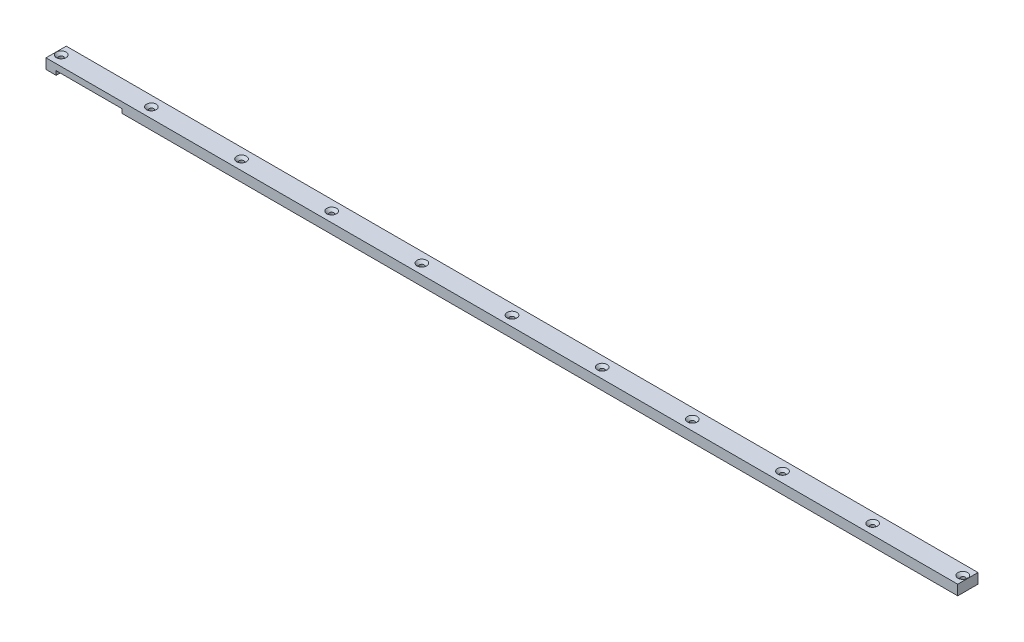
ISO-10303-21;
HEADER;
FILE_DESCRIPTION(('STEP AP214'),'2;1');
FILE_NAME('part.step','',(''),(''),'','','');
FILE_SCHEMA(('AUTOMOTIVE_DESIGN { 1 0 10303 214 1 1 1 1 }'));
ENDSEC;
DATA;
#1=APPLICATION_CONTEXT('core data for automotive mechanical design processes');
#2=APPLICATION_PROTOCOL_DEFINITION('international standard','automotive_design',2000,#1);
#3=PRODUCT_CONTEXT('',#1,'mechanical');
#4=PRODUCT('Part','Part','',(#3));
#5=PRODUCT_RELATED_PRODUCT_CATEGORY('part','',(#4));
#6=PRODUCT_DEFINITION_FORMATION('','',#4);
#7=PRODUCT_DEFINITION_CONTEXT('part definition',#1,'design');
#8=PRODUCT_DEFINITION('design','',#6,#7);
#9=PRODUCT_DEFINITION_SHAPE('','',#8);
#10=(LENGTH_UNIT() NAMED_UNIT(*) SI_UNIT(.MILLI.,.METRE.));
#11=(NAMED_UNIT(*) PLANE_ANGLE_UNIT() SI_UNIT($,.RADIAN.));
#12=(NAMED_UNIT(*) SI_UNIT($,.STERADIAN.) SOLID_ANGLE_UNIT());
#13=UNCERTAINTY_MEASURE_WITH_UNIT(LENGTH_MEASURE(1.E-05),#10,'distance_accuracy_value','');
#14=(GEOMETRIC_REPRESENTATION_CONTEXT(3) GLOBAL_UNCERTAINTY_ASSIGNED_CONTEXT((#13)) GLOBAL_UNIT_ASSIGNED_CONTEXT((#10,
#11,#12)) REPRESENTATION_CONTEXT('',''));
#15=CARTESIAN_POINT('',(0.,0.,0.));
#16=DIRECTION('',(0.,0.,1.));
#17=DIRECTION('',(1.,0.,0.));
#18=AXIS2_PLACEMENT_3D('',#15,#16,#17);
#19=CARTESIAN_POINT('',(-445.,10.,0.));
#20=DIRECTION('',(0.,1.,0.));
#21=DIRECTION('',(0.,0.,1.));
#22=AXIS2_PLACEMENT_3D('',#19,#20,#21);
#23=CYLINDRICAL_SURFACE('',#22,2.24999999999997);
#24=CARTESIAN_POINT('',(-445.,7.45000000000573,0.));
#25=DIRECTION('',(0.,1.,0.));
#26=DIRECTION('',(0.,0.,1.));
#27=AXIS2_PLACEMENT_3D('',#24,#25,#26);
#28=CIRCLE('',#27,2.25000000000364);
#29=CARTESIAN_POINT('',(-445.,7.45000000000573,2.25000000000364));
#30=VERTEX_POINT('',#29);
#31=EDGE_CURVE('E116',#30,#30,#28,.T.);
#32=ORIENTED_EDGE('',*,*,#31,.T.);
#33=EDGE_LOOP('',(#32));
#34=FACE_BOUND('',#33,.T.);
#35=CARTESIAN_POINT('',(-445.,0.,0.));
#36=DIRECTION('',(0.,1.,0.));
#37=DIRECTION('',(0.,0.,1.));
#38=AXIS2_PLACEMENT_3D('',#35,#36,#37);
#39=CIRCLE('',#38,2.24999999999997);
#40=CARTESIAN_POINT('',(-445.,0.,2.24999999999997));
#41=VERTEX_POINT('',#40);
#42=EDGE_CURVE('E117',#41,#41,#39,.F.);
#43=ORIENTED_EDGE('',*,*,#42,.T.);
#44=EDGE_LOOP('',(#43));
#45=FACE_BOUND('',#44,.T.);
#46=ADVANCED_FACE('F17',(#34,#45),#23,.F.);
#47=CARTESIAN_POINT('',(445.,10.,0.));
#48=DIRECTION('',(0.,1.,0.));
#49=DIRECTION('',(0.,0.,1.));
#50=AXIS2_PLACEMENT_3D('',#47,#48,#49);
#51=CYLINDRICAL_SURFACE('',#50,2.24999999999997);
#52=CARTESIAN_POINT('',(445.,7.45000000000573,0.));
#53=DIRECTION('',(0.,1.,0.));
#54=DIRECTION('',(0.,0.,1.));
#55=AXIS2_PLACEMENT_3D('',#52,#53,#54);
#56=CIRCLE('',#55,2.25000000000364);
#57=CARTESIAN_POINT('',(445.,7.45000000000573,2.25000000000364));
#58=VERTEX_POINT('',#57);
#59=EDGE_CURVE('E147',#58,#58,#56,.T.);
#60=ORIENTED_EDGE('',*,*,#59,.T.);
#61=EDGE_LOOP('',(#60));
#62=FACE_BOUND('',#61,.T.);
#63=CARTESIAN_POINT('',(445.,0.,0.));
#64=DIRECTION('',(0.,1.,0.));
#65=DIRECTION('',(0.,0.,1.));
#66=AXIS2_PLACEMENT_3D('',#63,#64,#65);
#67=CIRCLE('',#66,2.24999999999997);
#68=CARTESIAN_POINT('',(445.,0.,2.24999999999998));
#69=VERTEX_POINT('',#68);
#70=EDGE_CURVE('E20',#69,#69,#67,.F.);
#71=ORIENTED_EDGE('',*,*,#70,.T.);
#72=EDGE_LOOP('',(#71));
#73=FACE_BOUND('',#72,.T.);
#74=ADVANCED_FACE('F218',(#62,#73),#51,.F.);
#75=CARTESIAN_POINT('',(356.,10.,0.));
#76=DIRECTION('',(0.,1.,0.));
#77=DIRECTION('',(0.,0.,1.));
#78=AXIS2_PLACEMENT_3D('',#75,#76,#77);
#79=CYLINDRICAL_SURFACE('',#78,2.24999999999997);
#80=CARTESIAN_POINT('',(356.,7.45000000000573,0.));
#81=DIRECTION('',(0.,1.,0.));
#82=DIRECTION('',(0.,0.,1.));
#83=AXIS2_PLACEMENT_3D('',#80,#81,#82);
#84=CIRCLE('',#83,2.25000000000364);
#85=CARTESIAN_POINT('',(356.,7.45000000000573,2.25000000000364));
#86=VERTEX_POINT('',#85);
#87=EDGE_CURVE('E144',#86,#86,#84,.T.);
#88=ORIENTED_EDGE('',*,*,#87,.T.);
#89=EDGE_LOOP('',(#88));
#90=FACE_BOUND('',#89,.T.);
#91=CARTESIAN_POINT('',(356.,0.,0.));
#92=DIRECTION('',(0.,1.,0.));
#93=DIRECTION('',(0.,0.,1.));
#94=AXIS2_PLACEMENT_3D('',#91,#92,#93);
#95=CIRCLE('',#94,2.24999999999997);
#96=CARTESIAN_POINT('',(356.,0.,2.24999999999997));
#97=VERTEX_POINT('',#96);
#98=EDGE_CURVE('E211',#97,#97,#95,.F.);
#99=ORIENTED_EDGE('',*,*,#98,.T.);
#100=EDGE_LOOP('',(#99));
#101=FACE_BOUND('',#100,.T.);
#102=ADVANCED_FACE('F356',(#90,#101),#79,.F.);
#103=CARTESIAN_POINT('',(267.,10.,0.));
#104=DIRECTION('',(0.,1.,0.));
#105=DIRECTION('',(0.,0.,1.));
#106=AXIS2_PLACEMENT_3D('',#103,#104,#105);
#107=CYLINDRICAL_SURFACE('',#106,2.24999999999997);
#108=CARTESIAN_POINT('',(267.,7.45000000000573,0.));
#109=DIRECTION('',(0.,1.,0.));
#110=DIRECTION('',(0.,0.,1.));
#111=AXIS2_PLACEMENT_3D('',#108,#109,#110);
#112=CIRCLE('',#111,2.25000000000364);
#113=CARTESIAN_POINT('',(267.,7.45000000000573,2.25000000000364));
#114=VERTEX_POINT('',#113);
#115=EDGE_CURVE('E141',#114,#114,#112,.T.);
#116=ORIENTED_EDGE('',*,*,#115,.T.);
#117=EDGE_LOOP('',(#116));
#118=FACE_BOUND('',#117,.T.);
#119=CARTESIAN_POINT('',(267.,0.,0.));
#120=DIRECTION('',(0.,1.,0.));
#121=DIRECTION('',(0.,0.,1.));
#122=AXIS2_PLACEMENT_3D('',#119,#120,#121);
#123=CIRCLE('',#122,2.24999999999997);
#124=CARTESIAN_POINT('',(267.,0.,2.24999999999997));
#125=VERTEX_POINT('',#124);
#126=EDGE_CURVE('E209',#125,#125,#123,.F.);
#127=ORIENTED_EDGE('',*,*,#126,.T.);
#128=EDGE_LOOP('',(#127));
#129=FACE_BOUND('',#128,.T.);
#130=ADVANCED_FACE('F363',(#118,#129),#107,.F.);
#131=CARTESIAN_POINT('',(178.,10.,0.));
#132=DIRECTION('',(0.,1.,0.));
#133=DIRECTION('',(0.,0.,1.));
#134=AXIS2_PLACEMENT_3D('',#131,#132,#133);
#135=CYLINDRICAL_SURFACE('',#134,2.25);
#136=CARTESIAN_POINT('',(178.,7.45000000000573,0.));
#137=DIRECTION('',(0.,1.,0.));
#138=DIRECTION('',(0.,0.,1.));
#139=AXIS2_PLACEMENT_3D('',#136,#137,#138);
#140=CIRCLE('',#139,2.25000000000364);
#141=CARTESIAN_POINT('',(178.,7.45000000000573,2.25000000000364));
#142=VERTEX_POINT('',#141);
#143=EDGE_CURVE('E138',#142,#142,#140,.T.);
#144=ORIENTED_EDGE('',*,*,#143,.T.);
#145=EDGE_LOOP('',(#144));
#146=FACE_BOUND('',#145,.T.);
#147=CARTESIAN_POINT('',(178.,0.,0.));
#148=DIRECTION('',(0.,1.,0.));
#149=DIRECTION('',(0.,0.,1.));
#150=AXIS2_PLACEMENT_3D('',#147,#148,#149);
#151=CIRCLE('',#150,2.25);
#152=CARTESIAN_POINT('',(178.,0.,2.25));
#153=VERTEX_POINT('',#152);
#154=EDGE_CURVE('E206',#153,#153,#151,.F.);
#155=ORIENTED_EDGE('',*,*,#154,.T.);
#156=EDGE_LOOP('',(#155));
#157=FACE_BOUND('',#156,.T.);
#158=ADVANCED_FACE('F369',(#146,#157),#135,.F.);
#159=CARTESIAN_POINT('',(89.,10.,0.));
#160=DIRECTION('',(0.,1.,0.));
#161=DIRECTION('',(0.,0.,1.));
#162=AXIS2_PLACEMENT_3D('',#159,#160,#161);
#163=CYLINDRICAL_SURFACE('',#162,2.25);
#164=CARTESIAN_POINT('',(89.,7.45000000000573,0.));
#165=DIRECTION('',(0.,1.,0.));
#166=DIRECTION('',(0.,0.,1.));
#167=AXIS2_PLACEMENT_3D('',#164,#165,#166);
#168=CIRCLE('',#167,2.25000000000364);
#169=CARTESIAN_POINT('',(89.,7.45000000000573,2.25000000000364));
#170=VERTEX_POINT('',#169);
#171=EDGE_CURVE('E135',#170,#170,#168,.T.);
#172=ORIENTED_EDGE('',*,*,#171,.T.);
#173=EDGE_LOOP('',(#172));
#174=FACE_BOUND('',#173,.T.);
#175=CARTESIAN_POINT('',(89.,0.,0.));
#176=DIRECTION('',(0.,1.,0.));
#177=DIRECTION('',(0.,0.,1.));
#178=AXIS2_PLACEMENT_3D('',#175,#176,#177);
#179=CIRCLE('',#178,2.25);
#180=CARTESIAN_POINT('',(89.,0.,2.25));
#181=VERTEX_POINT('',#180);
#182=EDGE_CURVE('E203',#181,#181,#179,.F.);
#183=ORIENTED_EDGE('',*,*,#182,.T.);
#184=EDGE_LOOP('',(#183));
#185=FACE_BOUND('',#184,.T.);
#186=ADVANCED_FACE('F373',(#174,#185),#163,.F.);
#187=CARTESIAN_POINT('',(0.,10.,0.));
#188=DIRECTION('',(0.,1.,0.));
#189=DIRECTION('',(0.,0.,1.));
#190=AXIS2_PLACEMENT_3D('',#187,#188,#189);
#191=CYLINDRICAL_SURFACE('',#190,2.25);
#192=CARTESIAN_POINT('',(0.,7.44999999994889,0.));
#193=DIRECTION('',(0.,1.,0.));
#194=DIRECTION('',(0.,0.,1.));
#195=AXIS2_PLACEMENT_3D('',#192,#193,#194);
#196=CIRCLE('',#195,2.25000000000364);
#197=CARTESIAN_POINT('',(0.,7.44999999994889,2.25000000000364));
#198=VERTEX_POINT('',#197);
#199=EDGE_CURVE('E132',#198,#198,#196,.T.);
#200=ORIENTED_EDGE('',*,*,#199,.T.);
#201=EDGE_LOOP('',(#200));
#202=FACE_BOUND('',#201,.T.);
#203=CARTESIAN_POINT('',(0.,0.,0.));
#204=DIRECTION('',(0.,1.,0.));
#205=DIRECTION('',(0.,0.,1.));
#206=AXIS2_PLACEMENT_3D('',#203,#204,#205);
#207=CIRCLE('',#206,2.25);
#208=CARTESIAN_POINT('',(0.,0.,2.25));
#209=VERTEX_POINT('',#208);
#210=EDGE_CURVE('E200',#209,#209,#207,.F.);
#211=ORIENTED_EDGE('',*,*,#210,.T.);
#212=EDGE_LOOP('',(#211));
#213=FACE_BOUND('',#212,.T.);
#214=ADVANCED_FACE('F377',(#202,#213),#191,.F.);
#215=CARTESIAN_POINT('',(-89.,10.,0.));
#216=DIRECTION('',(0.,1.,0.));
#217=DIRECTION('',(0.,0.,1.));
#218=AXIS2_PLACEMENT_3D('',#215,#216,#217);
#219=CYLINDRICAL_SURFACE('',#218,2.25);
#220=CARTESIAN_POINT('',(-89.,7.45000000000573,0.));
#221=DIRECTION('',(0.,1.,0.));
#222=DIRECTION('',(0.,0.,1.));
#223=AXIS2_PLACEMENT_3D('',#220,#221,#222);
#224=CIRCLE('',#223,2.25000000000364);
#225=CARTESIAN_POINT('',(-89.,7.45000000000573,2.25000000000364));
#226=VERTEX_POINT('',#225);
#227=EDGE_CURVE('E129',#226,#226,#224,.T.);
#228=ORIENTED_EDGE('',*,*,#227,.T.);
#229=EDGE_LOOP('',(#228));
#230=FACE_BOUND('',#229,.T.);
#231=CARTESIAN_POINT('',(-89.,0.,0.));
#232=DIRECTION('',(0.,1.,0.));
#233=DIRECTION('',(0.,0.,1.));
#234=AXIS2_PLACEMENT_3D('',#231,#232,#233);
#235=CIRCLE('',#234,2.25);
#236=CARTESIAN_POINT('',(-89.,0.,2.25));
#237=VERTEX_POINT('',#236);
#238=EDGE_CURVE('E197',#237,#237,#235,.F.);
#239=ORIENTED_EDGE('',*,*,#238,.T.);
#240=EDGE_LOOP('',(#239));
#241=FACE_BOUND('',#240,.T.);
#242=ADVANCED_FACE('F381',(#230,#241),#219,.F.);
#243=CARTESIAN_POINT('',(-178.,10.,0.));
#244=DIRECTION('',(0.,1.,0.));
#245=DIRECTION('',(0.,0.,1.));
#246=AXIS2_PLACEMENT_3D('',#243,#244,#245);
#247=CYLINDRICAL_SURFACE('',#246,2.25);
#248=CARTESIAN_POINT('',(-178.,7.45000000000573,0.));
#249=DIRECTION('',(0.,1.,0.));
#250=DIRECTION('',(0.,0.,1.));
#251=AXIS2_PLACEMENT_3D('',#248,#249,#250);
#252=CIRCLE('',#251,2.25000000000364);
#253=CARTESIAN_POINT('',(-178.,7.45000000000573,2.25000000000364));
#254=VERTEX_POINT('',#253);
#255=EDGE_CURVE('E126',#254,#254,#252,.T.);
#256=ORIENTED_EDGE('',*,*,#255,.T.);
#257=EDGE_LOOP('',(#256));
#258=FACE_BOUND('',#257,.T.);
#259=CARTESIAN_POINT('',(-178.,0.,0.));
#260=DIRECTION('',(0.,1.,0.));
#261=DIRECTION('',(0.,0.,1.));
#262=AXIS2_PLACEMENT_3D('',#259,#260,#261);
#263=CIRCLE('',#262,2.25);
#264=CARTESIAN_POINT('',(-178.,0.,2.25));
#265=VERTEX_POINT('',#264);
#266=EDGE_CURVE('E194',#265,#265,#263,.F.);
#267=ORIENTED_EDGE('',*,*,#266,.T.);
#268=EDGE_LOOP('',(#267));
#269=FACE_BOUND('',#268,.T.);
#270=ADVANCED_FACE('F385',(#258,#269),#247,.F.);
#271=CARTESIAN_POINT('',(-267.,10.,0.));
#272=DIRECTION('',(0.,1.,0.));
#273=DIRECTION('',(0.,0.,1.));
#274=AXIS2_PLACEMENT_3D('',#271,#272,#273);
#275=CYLINDRICAL_SURFACE('',#274,2.24999999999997);
#276=CARTESIAN_POINT('',(-267.,7.45000000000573,0.));
#277=DIRECTION('',(0.,1.,0.));
#278=DIRECTION('',(0.,0.,1.));
#279=AXIS2_PLACEMENT_3D('',#276,#277,#278);
#280=CIRCLE('',#279,2.25000000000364);
#281=CARTESIAN_POINT('',(-267.,7.45000000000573,2.25000000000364));
#282=VERTEX_POINT('',#281);
#283=EDGE_CURVE('E123',#282,#282,#280,.T.);
#284=ORIENTED_EDGE('',*,*,#283,.T.);
#285=EDGE_LOOP('',(#284));
#286=FACE_BOUND('',#285,.T.);
#287=CARTESIAN_POINT('',(-267.,0.,0.));
#288=DIRECTION('',(0.,1.,0.));
#289=DIRECTION('',(0.,0.,1.));
#290=AXIS2_PLACEMENT_3D('',#287,#288,#289);
#291=CIRCLE('',#290,2.24999999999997);
#292=CARTESIAN_POINT('',(-267.,0.,2.24999999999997));
#293=VERTEX_POINT('',#292);
#294=EDGE_CURVE('E191',#293,#293,#291,.F.);
#295=ORIENTED_EDGE('',*,*,#294,.T.);
#296=EDGE_LOOP('',(#295));
#297=FACE_BOUND('',#296,.T.);
#298=ADVANCED_FACE('F230',(#286,#297),#275,.F.);
#299=CARTESIAN_POINT('',(-356.,10.,0.));
#300=DIRECTION('',(0.,1.,0.));
#301=DIRECTION('',(0.,0.,1.));
#302=AXIS2_PLACEMENT_3D('',#299,#300,#301);
#303=CYLINDRICAL_SURFACE('',#302,2.24999999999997);
#304=CARTESIAN_POINT('',(-356.,7.45000000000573,0.));
#305=DIRECTION('',(0.,1.,0.));
#306=DIRECTION('',(0.,0.,1.));
#307=AXIS2_PLACEMENT_3D('',#304,#305,#306);
#308=CIRCLE('',#307,2.25000000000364);
#309=CARTESIAN_POINT('',(-356.,7.45000000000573,2.25000000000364));
#310=VERTEX_POINT('',#309);
#311=EDGE_CURVE('E113',#310,#310,#308,.T.);
#312=ORIENTED_EDGE('',*,*,#311,.T.);
#313=EDGE_LOOP('',(#312));
#314=FACE_BOUND('',#313,.T.);
#315=CARTESIAN_POINT('',(-356.,0.,0.));
#316=DIRECTION('',(0.,1.,0.));
#317=DIRECTION('',(0.,0.,1.));
#318=AXIS2_PLACEMENT_3D('',#315,#316,#317);
#319=CIRCLE('',#318,2.24999999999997);
#320=CARTESIAN_POINT('',(-356.,0.,2.24999999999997));
#321=VERTEX_POINT('',#320);
#322=EDGE_CURVE('E93',#321,#321,#319,.F.);
#323=ORIENTED_EDGE('',*,*,#322,.T.);
#324=EDGE_LOOP('',(#323));
#325=FACE_BOUND('',#324,.T.);
#326=ADVANCED_FACE('F221',(#314,#325),#303,.F.);
#327=CARTESIAN_POINT('',(0.,0.,0.));
#328=DIRECTION('',(0.,1.,0.));
#329=DIRECTION('',(0.,0.,1.));
#330=AXIS2_PLACEMENT_3D('',#327,#328,#329);
#331=PLANE('',#330);
#332=DIRECTION('',(0.,0.,-1.));
#333=VECTOR('',#332,1.);
#334=CARTESIAN_POINT('',(-375.,0.,10.));
#335=LINE('',#334,#333);
#336=CARTESIAN_POINT('',(-375.,0.,10.));
#337=VERTEX_POINT('',#336);
#338=CARTESIAN_POINT('',(-375.,0.,-10.));
#339=VERTEX_POINT('',#338);
#340=EDGE_CURVE('E84',#337,#339,#335,.T.);
#341=ORIENTED_EDGE('',*,*,#340,.T.);
#342=DIRECTION('',(1.,0.,0.));
#343=VECTOR('',#342,1.);
#344=CARTESIAN_POINT('',(-450.,0.,-10.));
#345=LINE('',#344,#343);
#346=CARTESIAN_POINT('',(450.,0.,-10.));
#347=VERTEX_POINT('',#346);
#348=EDGE_CURVE('E88',#339,#347,#345,.T.);
#349=ORIENTED_EDGE('',*,*,#348,.T.);
#350=DIRECTION('',(0.,0.,1.));
#351=VECTOR('',#350,1.);
#352=CARTESIAN_POINT('',(450.,0.,-10.));
#353=LINE('',#352,#351);
#354=CARTESIAN_POINT('',(450.,0.,10.));
#355=VERTEX_POINT('',#354);
#356=EDGE_CURVE('E100',#347,#355,#353,.T.);
#357=ORIENTED_EDGE('',*,*,#356,.T.);
#358=DIRECTION('',(-1.,0.,0.));
#359=VECTOR('',#358,1.);
#360=CARTESIAN_POINT('',(-450.,0.,10.));
#361=LINE('',#360,#359);
#362=EDGE_CURVE('E91',#355,#337,#361,.T.);
#363=ORIENTED_EDGE('',*,*,#362,.T.);
#364=EDGE_LOOP('',(#341,#349,#357,#363));
#365=FACE_BOUND('',#364,.T.);
#366=ORIENTED_EDGE('',*,*,#322,.F.);
#367=EDGE_LOOP('',(#366));
#368=FACE_BOUND('',#367,.T.);
#369=ORIENTED_EDGE('',*,*,#294,.F.);
#370=EDGE_LOOP('',(#369));
#371=FACE_BOUND('',#370,.T.);
#372=ORIENTED_EDGE('',*,*,#266,.F.);
#373=EDGE_LOOP('',(#372));
#374=FACE_BOUND('',#373,.T.);
#375=ORIENTED_EDGE('',*,*,#238,.F.);
#376=EDGE_LOOP('',(#375));
#377=FACE_BOUND('',#376,.T.);
#378=ORIENTED_EDGE('',*,*,#210,.F.);
#379=EDGE_LOOP('',(#378));
#380=FACE_BOUND('',#379,.T.);
#381=ORIENTED_EDGE('',*,*,#182,.F.);
#382=EDGE_LOOP('',(#381));
#383=FACE_BOUND('',#382,.T.);
#384=ORIENTED_EDGE('',*,*,#154,.F.);
#385=EDGE_LOOP('',(#384));
#386=FACE_BOUND('',#385,.T.);
#387=ORIENTED_EDGE('',*,*,#126,.F.);
#388=EDGE_LOOP('',(#387));
#389=FACE_BOUND('',#388,.T.);
#390=ORIENTED_EDGE('',*,*,#98,.F.);
#391=EDGE_LOOP('',(#390));
#392=FACE_BOUND('',#391,.T.);
#393=ORIENTED_EDGE('',*,*,#70,.F.);
#394=EDGE_LOOP('',(#393));
#395=FACE_BOUND('',#394,.T.);
#396=ADVANCED_FACE('F85',(#365,#368,#371,#374,#377,#380,#383,#386,#389,#392,#395),#331,.F.);
#397=CARTESIAN_POINT('',(-375.,0.,10.));
#398=DIRECTION('',(1.,0.,0.));
#399=DIRECTION('',(0.,0.,-1.));
#400=AXIS2_PLACEMENT_3D('',#397,#398,#399);
#401=PLANE('',#400);
#402=ORIENTED_EDGE('',*,*,#340,.F.);
#403=DIRECTION('',(0.,1.,0.));
#404=VECTOR('',#403,1.);
#405=CARTESIAN_POINT('',(-375.,10.,10.));
#406=LINE('',#405,#404);
#407=CARTESIAN_POINT('',(-375.,3.99999999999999,10.));
#408=VERTEX_POINT('',#407);
#409=EDGE_CURVE('E316',#337,#408,#406,.T.);
#410=ORIENTED_EDGE('',*,*,#409,.T.);
#411=DIRECTION('',(0.,0.,1.));
#412=VECTOR('',#411,1.);
#413=CARTESIAN_POINT('',(-375.,3.99999999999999,10.));
#414=LINE('',#413,#412);
#415=CARTESIAN_POINT('',(-375.,3.99999999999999,-10.));
#416=VERTEX_POINT('',#415);
#417=EDGE_CURVE('E79',#408,#416,#414,.F.);
#418=ORIENTED_EDGE('',*,*,#417,.T.);
#419=DIRECTION('',(0.,1.,0.));
#420=VECTOR('',#419,1.);
#421=CARTESIAN_POINT('',(-375.,10.,-10.));
#422=LINE('',#421,#420);
#423=EDGE_CURVE('E96',#416,#339,#422,.F.);
#424=ORIENTED_EDGE('',*,*,#423,.T.);
#425=EDGE_LOOP('',(#402,#410,#418,#424));
#426=FACE_BOUND('',#425,.T.);
#427=ADVANCED_FACE('F97',(#426),#401,.F.);
#428=CARTESIAN_POINT('',(-440.,4.,10.));
#429=DIRECTION('',(0.,1.,0.));
#430=DIRECTION('',(-1.,0.,0.));
#431=AXIS2_PLACEMENT_3D('',#428,#429,#430);
#432=PLANE('',#431);
#433=ORIENTED_EDGE('',*,*,#417,.F.);
#434=DIRECTION('',(-1.,0.,0.));
#435=VECTOR('',#434,1.);
#436=CARTESIAN_POINT('',(-450.,3.99999999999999,10.));
#437=LINE('',#436,#435);
#438=CARTESIAN_POINT('',(-440.,4.,10.));
#439=VERTEX_POINT('',#438);
#440=EDGE_CURVE('E312',#408,#439,#437,.T.);
#441=ORIENTED_EDGE('',*,*,#440,.T.);
#442=DIRECTION('',(0.,0.,1.));
#443=VECTOR('',#442,1.);
#444=CARTESIAN_POINT('',(-440.,4.,10.));
#445=LINE('',#444,#443);
#446=CARTESIAN_POINT('',(-440.,4.,-10.));
#447=VERTEX_POINT('',#446);
#448=EDGE_CURVE('E118',#439,#447,#445,.F.);
#449=ORIENTED_EDGE('',*,*,#448,.T.);
#450=DIRECTION('',(1.,0.,0.));
#451=VECTOR('',#450,1.);
#452=CARTESIAN_POINT('',(-450.,4.,-10.));
#453=LINE('',#452,#451);
#454=EDGE_CURVE('E314',#447,#416,#453,.T.);
#455=ORIENTED_EDGE('',*,*,#454,.T.);
#456=EDGE_LOOP('',(#433,#441,#449,#455));
#457=FACE_BOUND('',#456,.T.);
#458=ADVANCED_FACE('F228',(#457),#432,.F.);
#459=CARTESIAN_POINT('',(-440.,0.,10.));
#460=DIRECTION('',(-1.,0.,0.));
#461=DIRECTION('',(0.,0.,1.));
#462=AXIS2_PLACEMENT_3D('',#459,#460,#461);
#463=PLANE('',#462);
#464=ORIENTED_EDGE('',*,*,#448,.F.);
#465=DIRECTION('',(0.,1.,0.));
#466=VECTOR('',#465,1.);
#467=CARTESIAN_POINT('',(-440.,10.,10.));
#468=LINE('',#467,#466);
#469=CARTESIAN_POINT('',(-440.,0.,10.));
#470=VERTEX_POINT('',#469);
#471=EDGE_CURVE('E318',#439,#470,#468,.F.);
#472=ORIENTED_EDGE('',*,*,#471,.T.);
#473=DIRECTION('',(0.,0.,1.));
#474=VECTOR('',#473,1.);
#475=CARTESIAN_POINT('',(-440.,0.,0.));
#476=LINE('',#475,#474);
#477=CARTESIAN_POINT('',(-440.,0.,-10.));
#478=VERTEX_POINT('',#477);
#479=EDGE_CURVE('E114',#470,#478,#476,.F.);
#480=ORIENTED_EDGE('',*,*,#479,.T.);
#481=DIRECTION('',(0.,1.,0.));
#482=VECTOR('',#481,1.);
#483=CARTESIAN_POINT('',(-440.,10.,-10.));
#484=LINE('',#483,#482);
#485=EDGE_CURVE('E335',#478,#447,#484,.T.);
#486=ORIENTED_EDGE('',*,*,#485,.T.);
#487=EDGE_LOOP('',(#464,#472,#480,#486));
#488=FACE_BOUND('',#487,.T.);
#489=ADVANCED_FACE('F302',(#488),#463,.F.);
#490=CARTESIAN_POINT('',(0.,0.,0.));
#491=DIRECTION('',(0.,1.,0.));
#492=DIRECTION('',(0.,0.,1.));
#493=AXIS2_PLACEMENT_3D('',#490,#491,#492);
#494=PLANE('',#493);
#495=ORIENTED_EDGE('',*,*,#479,.F.);
#496=DIRECTION('',(-1.,0.,0.));
#497=VECTOR('',#496,1.);
#498=CARTESIAN_POINT('',(-450.,0.,10.));
#499=LINE('',#498,#497);
#500=CARTESIAN_POINT('',(-450.,0.,10.));
#501=VERTEX_POINT('',#500);
#502=EDGE_CURVE('E186',#470,#501,#499,.T.);
#503=ORIENTED_EDGE('',*,*,#502,.T.);
#504=DIRECTION('',(0.,0.,-1.));
#505=VECTOR('',#504,1.);
#506=CARTESIAN_POINT('',(-450.,0.,-10.));
#507=LINE('',#506,#505);
#508=CARTESIAN_POINT('',(-450.,0.,-10.));
#509=VERTEX_POINT('',#508);
#510=EDGE_CURVE('E329',#501,#509,#507,.T.);
#511=ORIENTED_EDGE('',*,*,#510,.T.);
#512=DIRECTION('',(1.,0.,0.));
#513=VECTOR('',#512,1.);
#514=CARTESIAN_POINT('',(-450.,0.,-10.));
#515=LINE('',#514,#513);
#516=EDGE_CURVE('E108',#509,#478,#515,.T.);
#517=ORIENTED_EDGE('',*,*,#516,.T.);
#518=EDGE_LOOP('',(#495,#503,#511,#517));
#519=FACE_BOUND('',#518,.T.);
#520=ORIENTED_EDGE('',*,*,#42,.F.);
#521=EDGE_LOOP('',(#520));
#522=FACE_BOUND('',#521,.T.);
#523=ADVANCED_FACE('F298',(#519,#522),#494,.F.);
#524=CARTESIAN_POINT('',(-445.,9.99999999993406,0.));
#525=DIRECTION('',(0.,1.,0.));
#526=DIRECTION('',(0.,0.,1.));
#527=AXIS2_PLACEMENT_3D('',#524,#525,#526);
#528=CONICAL_SURFACE('',#527,4.79999999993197,0.785398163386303);
#529=CARTESIAN_POINT('',(-445.,9.99999999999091,0.));
#530=DIRECTION('',(0.,1.,0.));
#531=DIRECTION('',(0.,0.,1.));
#532=AXIS2_PLACEMENT_3D('',#529,#530,#531);
#533=CIRCLE('',#532,4.79999999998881);
#534=CARTESIAN_POINT('',(-445.,9.99999999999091,4.79999999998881));
#535=VERTEX_POINT('',#534);
#536=EDGE_CURVE('E183',#535,#535,#533,.F.);
#537=ORIENTED_EDGE('',*,*,#536,.F.);
#538=EDGE_LOOP('',(#537));
#539=FACE_BOUND('',#538,.T.);
#540=ORIENTED_EDGE('',*,*,#31,.F.);
#541=EDGE_LOOP('',(#540));
#542=FACE_BOUND('',#541,.T.);
#543=ADVANCED_FACE('F294',(#539,#542),#528,.F.);
#544=CARTESIAN_POINT('',(445.,9.99999999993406,0.));
#545=DIRECTION('',(0.,1.,0.));
#546=DIRECTION('',(0.,0.,1.));
#547=AXIS2_PLACEMENT_3D('',#544,#545,#546);
#548=CONICAL_SURFACE('',#547,4.79999999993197,0.785398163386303);
#549=CARTESIAN_POINT('',(445.,9.99999999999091,0.));
#550=DIRECTION('',(0.,1.,0.));
#551=DIRECTION('',(0.,0.,1.));
#552=AXIS2_PLACEMENT_3D('',#549,#550,#551);
#553=CIRCLE('',#552,4.79999999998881);
#554=CARTESIAN_POINT('',(445.,9.99999999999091,4.79999999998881));
#555=VERTEX_POINT('',#554);
#556=EDGE_CURVE('E180',#555,#555,#553,.F.);
#557=ORIENTED_EDGE('',*,*,#556,.F.);
#558=EDGE_LOOP('',(#557));
#559=FACE_BOUND('',#558,.T.);
#560=ORIENTED_EDGE('',*,*,#59,.F.);
#561=EDGE_LOOP('',(#560));
#562=FACE_BOUND('',#561,.T.);
#563=ADVANCED_FACE('F290',(#559,#562),#548,.F.);
#564=CARTESIAN_POINT('',(356.,9.99999999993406,0.));
#565=DIRECTION('',(0.,1.,0.));
#566=DIRECTION('',(0.,0.,1.));
#567=AXIS2_PLACEMENT_3D('',#564,#565,#566);
#568=CONICAL_SURFACE('',#567,4.79999999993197,0.785398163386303);
#569=CARTESIAN_POINT('',(356.,9.99999999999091,0.));
#570=DIRECTION('',(0.,1.,0.));
#571=DIRECTION('',(0.,0.,1.));
#572=AXIS2_PLACEMENT_3D('',#569,#570,#571);
#573=CIRCLE('',#572,4.79999999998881);
#574=CARTESIAN_POINT('',(356.,9.99999999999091,4.79999999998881));
#575=VERTEX_POINT('',#574);
#576=EDGE_CURVE('E177',#575,#575,#573,.F.);
#577=ORIENTED_EDGE('',*,*,#576,.F.);
#578=EDGE_LOOP('',(#577));
#579=FACE_BOUND('',#578,.T.);
#580=ORIENTED_EDGE('',*,*,#87,.F.);
#581=EDGE_LOOP('',(#580));
#582=FACE_BOUND('',#581,.T.);
#583=ADVANCED_FACE('F286',(#579,#582),#568,.F.);
#584=CARTESIAN_POINT('',(267.,9.99999999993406,0.));
#585=DIRECTION('',(0.,1.,0.));
#586=DIRECTION('',(0.,0.,1.));
#587=AXIS2_PLACEMENT_3D('',#584,#585,#586);
#588=CONICAL_SURFACE('',#587,4.79999999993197,0.785398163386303);
#589=CARTESIAN_POINT('',(267.,9.99999999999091,0.));
#590=DIRECTION('',(0.,1.,0.));
#591=DIRECTION('',(0.,0.,1.));
#592=AXIS2_PLACEMENT_3D('',#589,#590,#591);
#593=CIRCLE('',#592,4.79999999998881);
#594=CARTESIAN_POINT('',(267.,9.99999999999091,4.79999999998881));
#595=VERTEX_POINT('',#594);
#596=EDGE_CURVE('E174',#595,#595,#593,.F.);
#597=ORIENTED_EDGE('',*,*,#596,.F.);
#598=EDGE_LOOP('',(#597));
#599=FACE_BOUND('',#598,.T.);
#600=ORIENTED_EDGE('',*,*,#115,.F.);
#601=EDGE_LOOP('',(#600));
#602=FACE_BOUND('',#601,.T.);
#603=ADVANCED_FACE('F282',(#599,#602),#588,.F.);
#604=CARTESIAN_POINT('',(178.,9.99999999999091,0.));
#605=DIRECTION('',(0.,1.,0.));
#606=DIRECTION('',(0.,0.,1.));
#607=AXIS2_PLACEMENT_3D('',#604,#605,#606);
#608=CONICAL_SURFACE('',#607,4.79999999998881,0.785398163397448);
#609=CARTESIAN_POINT('',(178.,9.99999999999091,0.));
#610=DIRECTION('',(0.,1.,0.));
#611=DIRECTION('',(0.,0.,1.));
#612=AXIS2_PLACEMENT_3D('',#609,#610,#611);
#613=CIRCLE('',#612,4.79999999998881);
#614=CARTESIAN_POINT('',(178.,9.99999999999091,4.79999999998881));
#615=VERTEX_POINT('',#614);
#616=EDGE_CURVE('E171',#615,#615,#613,.F.);
#617=ORIENTED_EDGE('',*,*,#616,.F.);
#618=EDGE_LOOP('',(#617));
#619=FACE_BOUND('',#618,.T.);
#620=ORIENTED_EDGE('',*,*,#143,.F.);
#621=EDGE_LOOP('',(#620));
#622=FACE_BOUND('',#621,.T.);
#623=ADVANCED_FACE('F278',(#619,#622),#608,.F.);
#624=CARTESIAN_POINT('',(89.,9.99999999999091,0.));
#625=DIRECTION('',(0.,1.,0.));
#626=DIRECTION('',(0.,0.,1.));
#627=AXIS2_PLACEMENT_3D('',#624,#625,#626);
#628=CONICAL_SURFACE('',#627,4.79999999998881,0.785398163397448);
#629=CARTESIAN_POINT('',(89.,9.99999999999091,0.));
#630=DIRECTION('',(0.,1.,0.));
#631=DIRECTION('',(0.,0.,1.));
#632=AXIS2_PLACEMENT_3D('',#629,#630,#631);
#633=CIRCLE('',#632,4.79999999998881);
#634=CARTESIAN_POINT('',(89.,9.99999999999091,4.79999999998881));
#635=VERTEX_POINT('',#634);
#636=EDGE_CURVE('E168',#635,#635,#633,.F.);
#637=ORIENTED_EDGE('',*,*,#636,.F.);
#638=EDGE_LOOP('',(#637));
#639=FACE_BOUND('',#638,.T.);
#640=ORIENTED_EDGE('',*,*,#171,.F.);
#641=EDGE_LOOP('',(#640));
#642=FACE_BOUND('',#641,.T.);
#643=ADVANCED_FACE('F274',(#639,#642),#628,.F.);
#644=CARTESIAN_POINT('',(0.,9.99999999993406,0.));
#645=DIRECTION('',(0.,1.,0.));
#646=DIRECTION('',(0.,0.,1.));
#647=AXIS2_PLACEMENT_3D('',#644,#645,#646);
#648=CONICAL_SURFACE('',#647,4.79999999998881,0.785398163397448);
#649=CARTESIAN_POINT('',(0.,9.99999999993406,0.));
#650=DIRECTION('',(0.,1.,0.));
#651=DIRECTION('',(0.,0.,1.));
#652=AXIS2_PLACEMENT_3D('',#649,#650,#651);
#653=CIRCLE('',#652,4.79999999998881);
#654=CARTESIAN_POINT('',(0.,9.99999999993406,4.79999999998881));
#655=VERTEX_POINT('',#654);
#656=EDGE_CURVE('E165',#655,#655,#653,.F.);
#657=ORIENTED_EDGE('',*,*,#656,.F.);
#658=EDGE_LOOP('',(#657));
#659=FACE_BOUND('',#658,.T.);
#660=ORIENTED_EDGE('',*,*,#199,.F.);
#661=EDGE_LOOP('',(#660));
#662=FACE_BOUND('',#661,.T.);
#663=ADVANCED_FACE('F270',(#659,#662),#648,.F.);
#664=CARTESIAN_POINT('',(-89.,9.99999999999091,0.));
#665=DIRECTION('',(0.,1.,0.));
#666=DIRECTION('',(0.,0.,1.));
#667=AXIS2_PLACEMENT_3D('',#664,#665,#666);
#668=CONICAL_SURFACE('',#667,4.79999999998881,0.785398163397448);
#669=CARTESIAN_POINT('',(-89.,9.99999999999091,0.));
#670=DIRECTION('',(0.,1.,0.));
#671=DIRECTION('',(0.,0.,1.));
#672=AXIS2_PLACEMENT_3D('',#669,#670,#671);
#673=CIRCLE('',#672,4.79999999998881);
#674=CARTESIAN_POINT('',(-89.,9.99999999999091,4.79999999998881));
#675=VERTEX_POINT('',#674);
#676=EDGE_CURVE('E162',#675,#675,#673,.F.);
#677=ORIENTED_EDGE('',*,*,#676,.F.);
#678=EDGE_LOOP('',(#677));
#679=FACE_BOUND('',#678,.T.);
#680=ORIENTED_EDGE('',*,*,#227,.F.);
#681=EDGE_LOOP('',(#680));
#682=FACE_BOUND('',#681,.T.);
#683=ADVANCED_FACE('F266',(#679,#682),#668,.F.);
#684=CARTESIAN_POINT('',(-178.,9.99999999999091,0.));
#685=DIRECTION('',(0.,1.,0.));
#686=DIRECTION('',(0.,0.,1.));
#687=AXIS2_PLACEMENT_3D('',#684,#685,#686);
#688=CONICAL_SURFACE('',#687,4.79999999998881,0.785398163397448);
#689=CARTESIAN_POINT('',(-178.,9.99999999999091,0.));
#690=DIRECTION('',(0.,1.,0.));
#691=DIRECTION('',(0.,0.,1.));
#692=AXIS2_PLACEMENT_3D('',#689,#690,#691);
#693=CIRCLE('',#692,4.79999999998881);
#694=CARTESIAN_POINT('',(-178.,9.99999999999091,4.79999999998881));
#695=VERTEX_POINT('',#694);
#696=EDGE_CURVE('E159',#695,#695,#693,.F.);
#697=ORIENTED_EDGE('',*,*,#696,.F.);
#698=EDGE_LOOP('',(#697));
#699=FACE_BOUND('',#698,.T.);
#700=ORIENTED_EDGE('',*,*,#255,.F.);
#701=EDGE_LOOP('',(#700));
#702=FACE_BOUND('',#701,.T.);
#703=ADVANCED_FACE('F262',(#699,#702),#688,.F.);
#704=CARTESIAN_POINT('',(-267.,9.99999999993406,0.));
#705=DIRECTION('',(0.,1.,0.));
#706=DIRECTION('',(0.,0.,1.));
#707=AXIS2_PLACEMENT_3D('',#704,#705,#706);
#708=CONICAL_SURFACE('',#707,4.79999999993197,0.785398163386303);
#709=CARTESIAN_POINT('',(-267.,9.99999999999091,0.));
#710=DIRECTION('',(0.,1.,0.));
#711=DIRECTION('',(0.,0.,1.));
#712=AXIS2_PLACEMENT_3D('',#709,#710,#711);
#713=CIRCLE('',#712,4.79999999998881);
#714=CARTESIAN_POINT('',(-267.,9.99999999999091,4.79999999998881));
#715=VERTEX_POINT('',#714);
#716=EDGE_CURVE('E156',#715,#715,#713,.F.);
#717=ORIENTED_EDGE('',*,*,#716,.F.);
#718=EDGE_LOOP('',(#717));
#719=FACE_BOUND('',#718,.T.);
#720=ORIENTED_EDGE('',*,*,#283,.F.);
#721=EDGE_LOOP('',(#720));
#722=FACE_BOUND('',#721,.T.);
#723=ADVANCED_FACE('F258',(#719,#722),#708,.F.);
#724=CARTESIAN_POINT('',(-356.,9.99999999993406,0.));
#725=DIRECTION('',(0.,1.,0.));
#726=DIRECTION('',(0.,0.,1.));
#727=AXIS2_PLACEMENT_3D('',#724,#725,#726);
#728=CONICAL_SURFACE('',#727,4.79999999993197,0.785398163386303);
#729=CARTESIAN_POINT('',(-356.,9.99999999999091,0.));
#730=DIRECTION('',(0.,1.,0.));
#731=DIRECTION('',(0.,0.,1.));
#732=AXIS2_PLACEMENT_3D('',#729,#730,#731);
#733=CIRCLE('',#732,4.79999999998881);
#734=CARTESIAN_POINT('',(-356.,9.99999999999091,4.79999999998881));
#735=VERTEX_POINT('',#734);
#736=EDGE_CURVE('E152',#735,#735,#733,.F.);
#737=ORIENTED_EDGE('',*,*,#736,.F.);
#738=EDGE_LOOP('',(#737));
#739=FACE_BOUND('',#738,.T.);
#740=ORIENTED_EDGE('',*,*,#311,.F.);
#741=EDGE_LOOP('',(#740));
#742=FACE_BOUND('',#741,.T.);
#743=ADVANCED_FACE('F254',(#739,#742),#728,.F.);
#744=CARTESIAN_POINT('',(450.,10.,-10.));
#745=DIRECTION('',(-1.,0.,0.));
#746=DIRECTION('',(0.,0.,1.));
#747=AXIS2_PLACEMENT_3D('',#744,#745,#746);
#748=PLANE('',#747);
#749=DIRECTION('',(0.,1.,0.));
#750=VECTOR('',#749,1.);
#751=CARTESIAN_POINT('',(450.,10.,-10.));
#752=LINE('',#751,#750);
#753=CARTESIAN_POINT('',(450.,10.,-10.));
#754=VERTEX_POINT('',#753);
#755=EDGE_CURVE('E106',#347,#754,#752,.T.);
#756=ORIENTED_EDGE('',*,*,#755,.T.);
#757=DIRECTION('',(0.,0.,1.));
#758=VECTOR('',#757,1.);
#759=CARTESIAN_POINT('',(450.,10.,0.));
#760=LINE('',#759,#758);
#761=CARTESIAN_POINT('',(450.,10.,10.));
#762=VERTEX_POINT('',#761);
#763=EDGE_CURVE('E155',#762,#754,#760,.F.);
#764=ORIENTED_EDGE('',*,*,#763,.F.);
#765=DIRECTION('',(0.,1.,0.));
#766=VECTOR('',#765,1.);
#767=CARTESIAN_POINT('',(450.,10.,10.));
#768=LINE('',#767,#766);
#769=EDGE_CURVE('E325',#762,#355,#768,.F.);
#770=ORIENTED_EDGE('',*,*,#769,.T.);
#771=ORIENTED_EDGE('',*,*,#356,.F.);
#772=EDGE_LOOP('',(#756,#764,#770,#771));
#773=FACE_BOUND('',#772,.T.);
#774=ADVANCED_FACE('F251',(#773),#748,.F.);
#775=CARTESIAN_POINT('',(-450.,10.,-10.));
#776=DIRECTION('',(0.,0.,1.));
#777=DIRECTION('',(1.,0.,0.));
#778=AXIS2_PLACEMENT_3D('',#775,#776,#777);
#779=PLANE('',#778);
#780=ORIENTED_EDGE('',*,*,#485,.F.);
#781=ORIENTED_EDGE('',*,*,#516,.F.);
#782=DIRECTION('',(0.,1.,0.));
#783=VECTOR('',#782,1.);
#784=CARTESIAN_POINT('',(-450.,10.,-10.));
#785=LINE('',#784,#783);
#786=CARTESIAN_POINT('',(-450.,10.,-10.));
#787=VERTEX_POINT('',#786);
#788=EDGE_CURVE('E332',#509,#787,#785,.T.);
#789=ORIENTED_EDGE('',*,*,#788,.T.);
#790=DIRECTION('',(1.,0.,0.));
#791=VECTOR('',#790,1.);
#792=CARTESIAN_POINT('',(0.,10.,-10.));
#793=LINE('',#792,#791);
#794=EDGE_CURVE('E343',#754,#787,#793,.F.);
#795=ORIENTED_EDGE('',*,*,#794,.F.);
#796=ORIENTED_EDGE('',*,*,#755,.F.);
#797=ORIENTED_EDGE('',*,*,#348,.F.);
#798=ORIENTED_EDGE('',*,*,#423,.F.);
#799=ORIENTED_EDGE('',*,*,#454,.F.);
#800=EDGE_LOOP('',(#780,#781,#789,#795,#796,#797,#798,#799));
#801=FACE_BOUND('',#800,.T.);
#802=ADVANCED_FACE('F104',(#801),#779,.F.);
#803=CARTESIAN_POINT('',(-450.,10.,-10.));
#804=DIRECTION('',(1.,0.,0.));
#805=DIRECTION('',(0.,0.,-1.));
#806=AXIS2_PLACEMENT_3D('',#803,#804,#805);
#807=PLANE('',#806);
#808=DIRECTION('',(0.,1.,0.));
#809=VECTOR('',#808,1.);
#810=CARTESIAN_POINT('',(-450.,10.,10.));
#811=LINE('',#810,#809);
#812=CARTESIAN_POINT('',(-450.,10.,10.));
#813=VERTEX_POINT('',#812);
#814=EDGE_CURVE('E35',#501,#813,#811,.T.);
#815=ORIENTED_EDGE('',*,*,#814,.T.);
#816=DIRECTION('',(0.,0.,1.));
#817=VECTOR('',#816,1.);
#818=CARTESIAN_POINT('',(-450.,10.,0.));
#819=LINE('',#818,#817);
#820=EDGE_CURVE('E26',#787,#813,#819,.T.);
#821=ORIENTED_EDGE('',*,*,#820,.F.);
#822=ORIENTED_EDGE('',*,*,#788,.F.);
#823=ORIENTED_EDGE('',*,*,#510,.F.);
#824=EDGE_LOOP('',(#815,#821,#822,#823));
#825=FACE_BOUND('',#824,.T.);
#826=ADVANCED_FACE('F241',(#825),#807,.F.);
#827=CARTESIAN_POINT('',(-450.,10.,10.));
#828=DIRECTION('',(0.,0.,-1.));
#829=DIRECTION('',(-1.,0.,0.));
#830=AXIS2_PLACEMENT_3D('',#827,#828,#829);
#831=PLANE('',#830);
#832=ORIENTED_EDGE('',*,*,#471,.F.);
#833=ORIENTED_EDGE('',*,*,#440,.F.);
#834=ORIENTED_EDGE('',*,*,#409,.F.);
#835=ORIENTED_EDGE('',*,*,#362,.F.);
#836=ORIENTED_EDGE('',*,*,#769,.F.);
#837=DIRECTION('',(1.,0.,0.));
#838=VECTOR('',#837,1.);
#839=CARTESIAN_POINT('',(0.,10.,10.));
#840=LINE('',#839,#838);
#841=EDGE_CURVE('E11',#813,#762,#840,.T.);
#842=ORIENTED_EDGE('',*,*,#841,.F.);
#843=ORIENTED_EDGE('',*,*,#814,.F.);
#844=ORIENTED_EDGE('',*,*,#502,.F.);
#845=EDGE_LOOP('',(#832,#833,#834,#835,#836,#842,#843,#844));
#846=FACE_BOUND('',#845,.T.);
#847=ADVANCED_FACE('F235',(#846),#831,.F.);
#848=CARTESIAN_POINT('',(0.,10.,0.));
#849=DIRECTION('',(0.,1.,0.));
#850=DIRECTION('',(0.,0.,1.));
#851=AXIS2_PLACEMENT_3D('',#848,#849,#850);
#852=PLANE('',#851);
#853=ORIENTED_EDGE('',*,*,#820,.T.);
#854=ORIENTED_EDGE('',*,*,#841,.T.);
#855=ORIENTED_EDGE('',*,*,#763,.T.);
#856=ORIENTED_EDGE('',*,*,#794,.T.);
#857=EDGE_LOOP('',(#853,#854,#855,#856));
#858=FACE_BOUND('',#857,.T.);
#859=ORIENTED_EDGE('',*,*,#736,.T.);
#860=EDGE_LOOP('',(#859));
#861=FACE_BOUND('',#860,.T.);
#862=ORIENTED_EDGE('',*,*,#716,.T.);
#863=EDGE_LOOP('',(#862));
#864=FACE_BOUND('',#863,.T.);
#865=ORIENTED_EDGE('',*,*,#696,.T.);
#866=EDGE_LOOP('',(#865));
#867=FACE_BOUND('',#866,.T.);
#868=ORIENTED_EDGE('',*,*,#676,.T.);
#869=EDGE_LOOP('',(#868));
#870=FACE_BOUND('',#869,.T.);
#871=ORIENTED_EDGE('',*,*,#656,.T.);
#872=EDGE_LOOP('',(#871));
#873=FACE_BOUND('',#872,.T.);
#874=ORIENTED_EDGE('',*,*,#636,.T.);
#875=EDGE_LOOP('',(#874));
#876=FACE_BOUND('',#875,.T.);
#877=ORIENTED_EDGE('',*,*,#616,.T.);
#878=EDGE_LOOP('',(#877));
#879=FACE_BOUND('',#878,.T.);
#880=ORIENTED_EDGE('',*,*,#596,.T.);
#881=EDGE_LOOP('',(#880));
#882=FACE_BOUND('',#881,.T.);
#883=ORIENTED_EDGE('',*,*,#576,.T.);
#884=EDGE_LOOP('',(#883));
#885=FACE_BOUND('',#884,.T.);
#886=ORIENTED_EDGE('',*,*,#556,.T.);
#887=EDGE_LOOP('',(#886));
#888=FACE_BOUND('',#887,.T.);
#889=ORIENTED_EDGE('',*,*,#536,.T.);
#890=EDGE_LOOP('',(#889));
#891=FACE_BOUND('',#890,.T.);
#892=ADVANCED_FACE('F233',(#858,#861,#864,#867,#870,#873,#876,#879,#882,#885,#888,#891),#852,.T.);
#893=CLOSED_SHELL('',(#46,#74,#102,#130,#158,#186,#214,#242,#270,#298,#326,#396,#427,#458,#489,
#523,#543,#563,#583,#603,#623,#643,#663,#683,#703,#723,#743,#774,#802,#826,#847,#892));
#894=MANIFOLD_SOLID_BREP('B1',#893);
#895=ADVANCED_BREP_SHAPE_REPRESENTATION('',(#18,#894),#14);
#896=SHAPE_DEFINITION_REPRESENTATION(#9,#895);
ENDSEC;
END-ISO-10303-21;
